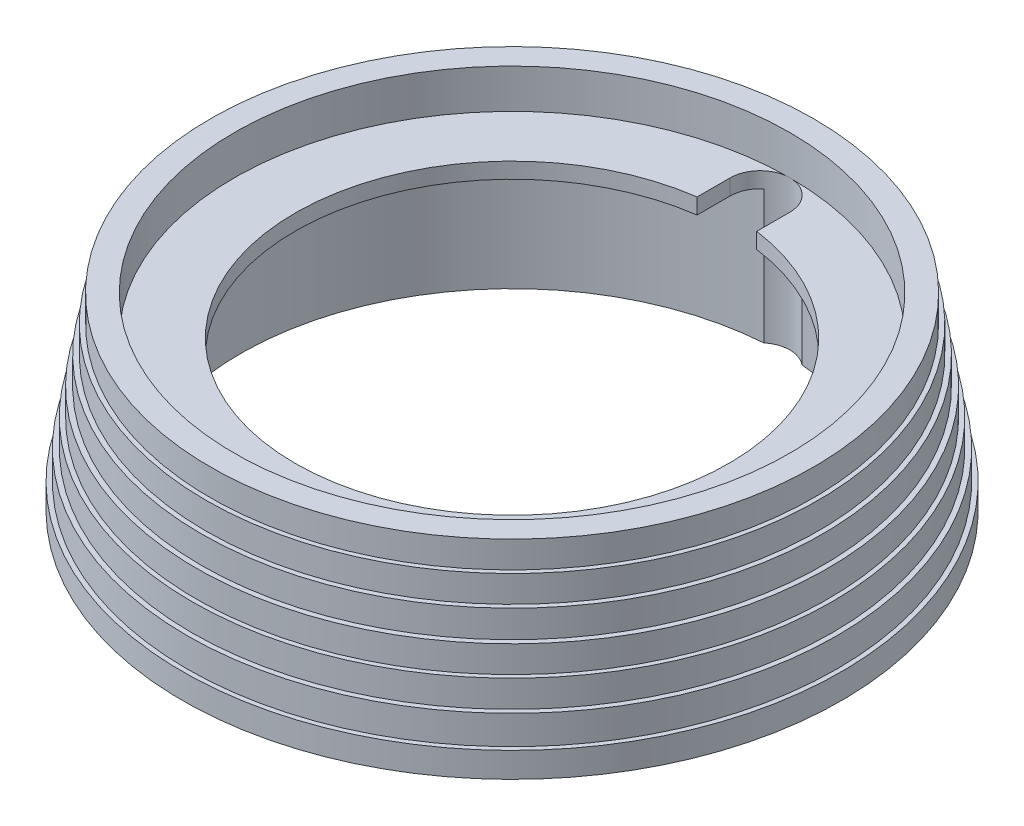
ISO-10303-21;
HEADER;
FILE_DESCRIPTION(('STEP AP214'),'2;1');
FILE_NAME('part.step','',(''),(''),'','','');
FILE_SCHEMA(('AUTOMOTIVE_DESIGN { 1 0 10303 214 1 1 1 1 }'));
ENDSEC;
DATA;
#1=APPLICATION_CONTEXT('core data for automotive mechanical design processes');
#2=APPLICATION_PROTOCOL_DEFINITION('international standard','automotive_design',2000,#1);
#3=PRODUCT_CONTEXT('',#1,'mechanical');
#4=PRODUCT('Part','Part','',(#3));
#5=PRODUCT_RELATED_PRODUCT_CATEGORY('part','',(#4));
#6=PRODUCT_DEFINITION_FORMATION('','',#4);
#7=PRODUCT_DEFINITION_CONTEXT('part definition',#1,'design');
#8=PRODUCT_DEFINITION('design','',#6,#7);
#9=PRODUCT_DEFINITION_SHAPE('','',#8);
#10=(LENGTH_UNIT() NAMED_UNIT(*) SI_UNIT(.MILLI.,.METRE.));
#11=(NAMED_UNIT(*) PLANE_ANGLE_UNIT() SI_UNIT($,.RADIAN.));
#12=(NAMED_UNIT(*) SI_UNIT($,.STERADIAN.) SOLID_ANGLE_UNIT());
#13=UNCERTAINTY_MEASURE_WITH_UNIT(LENGTH_MEASURE(1.E-05),#10,'distance_accuracy_value','');
#14=(GEOMETRIC_REPRESENTATION_CONTEXT(3) GLOBAL_UNCERTAINTY_ASSIGNED_CONTEXT((#13)) GLOBAL_UNIT_ASSIGNED_CONTEXT((#10,
#11,#12)) REPRESENTATION_CONTEXT('',''));
#15=CARTESIAN_POINT('',(0.,0.,0.));
#16=DIRECTION('',(0.,0.,1.));
#17=DIRECTION('',(1.,0.,0.));
#18=AXIS2_PLACEMENT_3D('',#15,#16,#17);
#19=CARTESIAN_POINT('',(0.,0.,0.));
#20=DIRECTION('',(0.,-1.,0.));
#21=DIRECTION('',(0.,0.,-1.));
#22=AXIS2_PLACEMENT_3D('',#19,#20,#21);
#23=CYLINDRICAL_SURFACE('',#22,17.5514);
#24=DIRECTION('',(0.,-1.,0.));
#25=VECTOR('',#24,1.);
#26=CARTESIAN_POINT('',(2.413,0.,-17.3847367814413));
#27=LINE('',#26,#25);
#28=CARTESIAN_POINT('',(2.413,10.795,-17.3847367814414));
#29=VERTEX_POINT('',#28);
#30=CARTESIAN_POINT('',(2.413,12.065,-17.3847367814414));
#31=VERTEX_POINT('',#30);
#32=EDGE_CURVE('E116',#29,#31,#27,.F.);
#33=ORIENTED_EDGE('',*,*,#32,.F.);
#34=CARTESIAN_POINT('',(0.,10.795,0.));
#35=DIRECTION('',(0.,-1.,0.));
#36=DIRECTION('',(0.,0.,-1.));
#37=AXIS2_PLACEMENT_3D('',#34,#35,#36);
#38=CIRCLE('',#37,17.5514);
#39=CARTESIAN_POINT('',(-2.413,10.795,-17.3847367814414));
#40=VERTEX_POINT('',#39);
#41=EDGE_CURVE('E129',#29,#40,#38,.T.);
#42=ORIENTED_EDGE('',*,*,#41,.T.);
#43=DIRECTION('',(0.,-1.,0.));
#44=VECTOR('',#43,1.);
#45=CARTESIAN_POINT('',(-2.413,0.,-17.3847367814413));
#46=LINE('',#45,#44);
#47=CARTESIAN_POINT('',(-2.413,12.065,-17.3847367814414));
#48=VERTEX_POINT('',#47);
#49=EDGE_CURVE('E50',#48,#40,#46,.T.);
#50=ORIENTED_EDGE('',*,*,#49,.F.);
#51=CARTESIAN_POINT('',(0.,12.065,0.));
#52=DIRECTION('',(0.,-1.,0.));
#53=DIRECTION('',(0.,0.,-1.));
#54=AXIS2_PLACEMENT_3D('',#51,#52,#53);
#55=CIRCLE('',#54,17.5514);
#56=EDGE_CURVE('E109',#31,#48,#55,.T.);
#57=ORIENTED_EDGE('',*,*,#56,.F.);
#58=EDGE_LOOP('',(#33,#42,#50,#57));
#59=FACE_BOUND('',#58,.T.);
#60=ADVANCED_FACE('F34',(#59),#23,.F.);
#61=CARTESIAN_POINT('',(26.67,0.,0.));
#62=DIRECTION('',(0.,-1.,0.));
#63=DIRECTION('',(0.,0.,-1.));
#64=AXIS2_PLACEMENT_3D('',#61,#62,#63);
#65=PLANE('',#64);
#66=CARTESIAN_POINT('',(0.,0.,-20.066));
#67=DIRECTION('',(0.,-1.,0.));
#68=DIRECTION('',(0.,0.,-1.));
#69=AXIS2_PLACEMENT_3D('',#66,#67,#68);
#70=CIRCLE('',#69,2.413);
#71=CARTESIAN_POINT('',(-1.54880738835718,0.,-21.9163417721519));
#72=VERTEX_POINT('',#71);
#73=CARTESIAN_POINT('',(1.54880738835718,0.,-21.9163417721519));
#74=VERTEX_POINT('',#73);
#75=EDGE_CURVE('E121',#72,#74,#70,.T.);
#76=ORIENTED_EDGE('',*,*,#75,.F.);
#77=CARTESIAN_POINT('',(0.,0.,0.));
#78=DIRECTION('',(0.,-1.,0.));
#79=DIRECTION('',(0.,0.,-1.));
#80=AXIS2_PLACEMENT_3D('',#77,#78,#79);
#81=CIRCLE('',#80,21.971);
#82=EDGE_CURVE('E125',#74,#72,#81,.T.);
#83=ORIENTED_EDGE('',*,*,#82,.F.);
#84=EDGE_LOOP('',(#76,#83));
#85=FACE_BOUND('',#84,.T.);
#86=CARTESIAN_POINT('',(0.,0.,0.));
#87=DIRECTION('',(0.,-1.,0.));
#88=DIRECTION('',(0.,0.,-1.));
#89=AXIS2_PLACEMENT_3D('',#86,#87,#88);
#90=CIRCLE('',#89,26.67);
#91=CARTESIAN_POINT('',(0.,0.,-26.67));
#92=VERTEX_POINT('',#91);
#93=EDGE_CURVE('E132',#92,#92,#90,.T.);
#94=ORIENTED_EDGE('',*,*,#93,.T.);
#95=EDGE_LOOP('',(#94));
#96=FACE_BOUND('',#95,.T.);
#97=ADVANCED_FACE('F36',(#85,#96),#65,.T.);
#98=CARTESIAN_POINT('',(17.5514,12.065,0.));
#99=DIRECTION('',(0.,1.,0.));
#100=DIRECTION('',(0.,0.,1.));
#101=AXIS2_PLACEMENT_3D('',#98,#99,#100);
#102=PLANE('',#101);
#103=DIRECTION('',(0.,0.,-1.));
#104=VECTOR('',#103,1.);
#105=CARTESIAN_POINT('',(2.413,12.065,-20.066));
#106=LINE('',#105,#104);
#107=CARTESIAN_POINT('',(2.413,12.065,-20.066));
#108=VERTEX_POINT('',#107);
#109=EDGE_CURVE('E103',#31,#108,#106,.T.);
#110=ORIENTED_EDGE('',*,*,#109,.F.);
#111=ORIENTED_EDGE('',*,*,#56,.T.);
#112=DIRECTION('',(0.,0.,1.));
#113=VECTOR('',#112,1.);
#114=CARTESIAN_POINT('',(-2.413,12.065,-20.066));
#115=LINE('',#114,#113);
#116=CARTESIAN_POINT('',(-2.413,12.065,-20.066));
#117=VERTEX_POINT('',#116);
#118=EDGE_CURVE('E100',#117,#48,#115,.T.);
#119=ORIENTED_EDGE('',*,*,#118,.F.);
#120=CARTESIAN_POINT('',(0.,12.065,-20.066));
#121=DIRECTION('',(0.,1.,0.));
#122=DIRECTION('',(0.,0.,1.));
#123=AXIS2_PLACEMENT_3D('',#120,#121,#122);
#124=CIRCLE('',#123,2.413);
#125=CARTESIAN_POINT('',(0.,12.065,-22.479));
#126=VERTEX_POINT('',#125);
#127=EDGE_CURVE('E88',#126,#117,#124,.T.);
#128=ORIENTED_EDGE('',*,*,#127,.F.);
#129=CARTESIAN_POINT('',(0.,12.065,0.));
#130=DIRECTION('',(0.,-1.,0.));
#131=DIRECTION('',(0.,0.,-1.));
#132=AXIS2_PLACEMENT_3D('',#129,#130,#131);
#133=CIRCLE('',#132,22.479);
#134=EDGE_CURVE('E177',#126,#126,#133,.T.);
#135=ORIENTED_EDGE('',*,*,#134,.F.);
#136=EDGE_CURVE('E93',#108,#126,#124,.T.);
#137=ORIENTED_EDGE('',*,*,#136,.F.);
#138=EDGE_LOOP('',(#110,#111,#119,#128,#135,#137));
#139=FACE_BOUND('',#138,.T.);
#140=ADVANCED_FACE('F107',(#139),#102,.T.);
#141=CARTESIAN_POINT('',(0.,0.,0.));
#142=DIRECTION('',(0.,-1.,0.));
#143=DIRECTION('',(0.,0.,-1.));
#144=AXIS2_PLACEMENT_3D('',#141,#142,#143);
#145=CYLINDRICAL_SURFACE('',#144,22.479);
#146=ORIENTED_EDGE('',*,*,#134,.T.);
#147=EDGE_LOOP('',(#146));
#148=FACE_BOUND('',#147,.T.);
#149=CARTESIAN_POINT('',(0.,15.24,0.));
#150=DIRECTION('',(0.,-1.,0.));
#151=DIRECTION('',(0.,0.,-1.));
#152=AXIS2_PLACEMENT_3D('',#149,#150,#151);
#153=CIRCLE('',#152,22.479);
#154=CARTESIAN_POINT('',(0.,15.24,-22.479));
#155=VERTEX_POINT('',#154);
#156=EDGE_CURVE('E174',#155,#155,#153,.T.);
#157=ORIENTED_EDGE('',*,*,#156,.F.);
#158=EDGE_LOOP('',(#157));
#159=FACE_BOUND('',#158,.T.);
#160=ADVANCED_FACE('F221',(#148,#159),#145,.F.);
#161=CARTESIAN_POINT('',(24.4094,15.24,0.));
#162=DIRECTION('',(0.,1.,0.));
#163=DIRECTION('',(0.,0.,1.));
#164=AXIS2_PLACEMENT_3D('',#161,#162,#163);
#165=PLANE('',#164);
#166=ORIENTED_EDGE('',*,*,#156,.T.);
#167=EDGE_LOOP('',(#166));
#168=FACE_BOUND('',#167,.T.);
#169=CARTESIAN_POINT('',(0.,15.24,0.));
#170=DIRECTION('',(0.,-1.,0.));
#171=DIRECTION('',(0.,0.,-1.));
#172=AXIS2_PLACEMENT_3D('',#169,#170,#171);
#173=CIRCLE('',#172,24.4094);
#174=CARTESIAN_POINT('',(0.,15.24,-24.4094));
#175=VERTEX_POINT('',#174);
#176=EDGE_CURVE('E171',#175,#175,#173,.T.);
#177=ORIENTED_EDGE('',*,*,#176,.F.);
#178=EDGE_LOOP('',(#177));
#179=FACE_BOUND('',#178,.T.);
#180=ADVANCED_FACE('F224',(#168,#179),#165,.T.);
#181=CARTESIAN_POINT('',(0.,0.,0.));
#182=DIRECTION('',(0.,-1.,0.));
#183=DIRECTION('',(0.,0.,-1.));
#184=AXIS2_PLACEMENT_3D('',#181,#182,#183);
#185=CYLINDRICAL_SURFACE('',#184,24.4094);
#186=ORIENTED_EDGE('',*,*,#176,.T.);
#187=EDGE_LOOP('',(#186));
#188=FACE_BOUND('',#187,.T.);
#189=CARTESIAN_POINT('',(0.,13.081,0.));
#190=DIRECTION('',(0.,-1.,0.));
#191=DIRECTION('',(0.,0.,-1.));
#192=AXIS2_PLACEMENT_3D('',#189,#190,#191);
#193=CIRCLE('',#192,24.4094);
#194=CARTESIAN_POINT('',(0.,13.081,-24.4094));
#195=VERTEX_POINT('',#194);
#196=EDGE_CURVE('E168',#195,#195,#193,.T.);
#197=ORIENTED_EDGE('',*,*,#196,.F.);
#198=EDGE_LOOP('',(#197));
#199=FACE_BOUND('',#198,.T.);
#200=ADVANCED_FACE('F228',(#188,#199),#185,.T.);
#201=CARTESIAN_POINT('',(24.765,13.081,0.));
#202=DIRECTION('',(0.,1.,0.));
#203=DIRECTION('',(0.,0.,1.));
#204=AXIS2_PLACEMENT_3D('',#201,#202,#203);
#205=PLANE('',#204);
#206=ORIENTED_EDGE('',*,*,#196,.T.);
#207=EDGE_LOOP('',(#206));
#208=FACE_BOUND('',#207,.T.);
#209=CARTESIAN_POINT('',(0.,13.081,0.));
#210=DIRECTION('',(0.,-1.,0.));
#211=DIRECTION('',(0.,0.,-1.));
#212=AXIS2_PLACEMENT_3D('',#209,#210,#211);
#213=CIRCLE('',#212,24.765);
#214=CARTESIAN_POINT('',(0.,13.081,-24.765));
#215=VERTEX_POINT('',#214);
#216=EDGE_CURVE('E165',#215,#215,#213,.T.);
#217=ORIENTED_EDGE('',*,*,#216,.F.);
#218=EDGE_LOOP('',(#217));
#219=FACE_BOUND('',#218,.T.);
#220=ADVANCED_FACE('F232',(#208,#219),#205,.T.);
#221=CARTESIAN_POINT('',(0.,0.,0.));
#222=DIRECTION('',(0.,-1.,0.));
#223=DIRECTION('',(0.,0.,-1.));
#224=AXIS2_PLACEMENT_3D('',#221,#222,#223);
#225=CYLINDRICAL_SURFACE('',#224,24.765);
#226=ORIENTED_EDGE('',*,*,#216,.T.);
#227=EDGE_LOOP('',(#226));
#228=FACE_BOUND('',#227,.T.);
#229=CARTESIAN_POINT('',(0.,10.922,0.));
#230=DIRECTION('',(0.,-1.,0.));
#231=DIRECTION('',(0.,0.,-1.));
#232=AXIS2_PLACEMENT_3D('',#229,#230,#231);
#233=CIRCLE('',#232,24.765);
#234=CARTESIAN_POINT('',(0.,10.922,-24.765));
#235=VERTEX_POINT('',#234);
#236=EDGE_CURVE('E162',#235,#235,#233,.T.);
#237=ORIENTED_EDGE('',*,*,#236,.F.);
#238=EDGE_LOOP('',(#237));
#239=FACE_BOUND('',#238,.T.);
#240=ADVANCED_FACE('F236',(#228,#239),#225,.T.);
#241=CARTESIAN_POINT('',(25.146,10.922,0.));
#242=DIRECTION('',(0.,1.,0.));
#243=DIRECTION('',(0.,0.,1.));
#244=AXIS2_PLACEMENT_3D('',#241,#242,#243);
#245=PLANE('',#244);
#246=ORIENTED_EDGE('',*,*,#236,.T.);
#247=EDGE_LOOP('',(#246));
#248=FACE_BOUND('',#247,.T.);
#249=CARTESIAN_POINT('',(0.,10.922,0.));
#250=DIRECTION('',(0.,-1.,0.));
#251=DIRECTION('',(0.,0.,-1.));
#252=AXIS2_PLACEMENT_3D('',#249,#250,#251);
#253=CIRCLE('',#252,25.146);
#254=CARTESIAN_POINT('',(0.,10.922,-25.146));
#255=VERTEX_POINT('',#254);
#256=EDGE_CURVE('E159',#255,#255,#253,.T.);
#257=ORIENTED_EDGE('',*,*,#256,.F.);
#258=EDGE_LOOP('',(#257));
#259=FACE_BOUND('',#258,.T.);
#260=ADVANCED_FACE('F240',(#248,#259),#245,.T.);
#261=CARTESIAN_POINT('',(0.,0.,0.));
#262=DIRECTION('',(0.,-1.,0.));
#263=DIRECTION('',(0.,0.,-1.));
#264=AXIS2_PLACEMENT_3D('',#261,#262,#263);
#265=CYLINDRICAL_SURFACE('',#264,25.146);
#266=ORIENTED_EDGE('',*,*,#256,.T.);
#267=EDGE_LOOP('',(#266));
#268=FACE_BOUND('',#267,.T.);
#269=CARTESIAN_POINT('',(0.,8.7122,0.));
#270=DIRECTION('',(0.,-1.,0.));
#271=DIRECTION('',(0.,0.,-1.));
#272=AXIS2_PLACEMENT_3D('',#269,#270,#271);
#273=CIRCLE('',#272,25.146);
#274=CARTESIAN_POINT('',(0.,8.7122,-25.146));
#275=VERTEX_POINT('',#274);
#276=EDGE_CURVE('E156',#275,#275,#273,.T.);
#277=ORIENTED_EDGE('',*,*,#276,.F.);
#278=EDGE_LOOP('',(#277));
#279=FACE_BOUND('',#278,.T.);
#280=ADVANCED_FACE('F244',(#268,#279),#265,.T.);
#281=CARTESIAN_POINT('',(25.5524,8.7122,0.));
#282=DIRECTION('',(0.,1.,0.));
#283=DIRECTION('',(0.,0.,1.));
#284=AXIS2_PLACEMENT_3D('',#281,#282,#283);
#285=PLANE('',#284);
#286=ORIENTED_EDGE('',*,*,#276,.T.);
#287=EDGE_LOOP('',(#286));
#288=FACE_BOUND('',#287,.T.);
#289=CARTESIAN_POINT('',(0.,8.7122,0.));
#290=DIRECTION('',(0.,-1.,0.));
#291=DIRECTION('',(0.,0.,-1.));
#292=AXIS2_PLACEMENT_3D('',#289,#290,#291);
#293=CIRCLE('',#292,25.5524);
#294=CARTESIAN_POINT('',(0.,8.7122,-25.5524));
#295=VERTEX_POINT('',#294);
#296=EDGE_CURVE('E153',#295,#295,#293,.T.);
#297=ORIENTED_EDGE('',*,*,#296,.F.);
#298=EDGE_LOOP('',(#297));
#299=FACE_BOUND('',#298,.T.);
#300=ADVANCED_FACE('F248',(#288,#299),#285,.T.);
#301=CARTESIAN_POINT('',(0.,0.,0.));
#302=DIRECTION('',(0.,-1.,0.));
#303=DIRECTION('',(0.,0.,-1.));
#304=AXIS2_PLACEMENT_3D('',#301,#302,#303);
#305=CYLINDRICAL_SURFACE('',#304,25.5524);
#306=ORIENTED_EDGE('',*,*,#296,.T.);
#307=EDGE_LOOP('',(#306));
#308=FACE_BOUND('',#307,.T.);
#309=CARTESIAN_POINT('',(0.,6.5532,0.));
#310=DIRECTION('',(0.,-1.,0.));
#311=DIRECTION('',(0.,0.,-1.));
#312=AXIS2_PLACEMENT_3D('',#309,#310,#311);
#313=CIRCLE('',#312,25.5524);
#314=CARTESIAN_POINT('',(0.,6.5532,-25.5524));
#315=VERTEX_POINT('',#314);
#316=EDGE_CURVE('E150',#315,#315,#313,.T.);
#317=ORIENTED_EDGE('',*,*,#316,.F.);
#318=EDGE_LOOP('',(#317));
#319=FACE_BOUND('',#318,.T.);
#320=ADVANCED_FACE('F252',(#308,#319),#305,.T.);
#321=CARTESIAN_POINT('',(25.908,6.5532,0.));
#322=DIRECTION('',(0.,1.,0.));
#323=DIRECTION('',(0.,0.,1.));
#324=AXIS2_PLACEMENT_3D('',#321,#322,#323);
#325=PLANE('',#324);
#326=ORIENTED_EDGE('',*,*,#316,.T.);
#327=EDGE_LOOP('',(#326));
#328=FACE_BOUND('',#327,.T.);
#329=CARTESIAN_POINT('',(0.,6.5532,0.));
#330=DIRECTION('',(0.,-1.,0.));
#331=DIRECTION('',(0.,0.,-1.));
#332=AXIS2_PLACEMENT_3D('',#329,#330,#331);
#333=CIRCLE('',#332,25.908);
#334=CARTESIAN_POINT('',(0.,6.5532,-25.908));
#335=VERTEX_POINT('',#334);
#336=EDGE_CURVE('E147',#335,#335,#333,.T.);
#337=ORIENTED_EDGE('',*,*,#336,.F.);
#338=EDGE_LOOP('',(#337));
#339=FACE_BOUND('',#338,.T.);
#340=ADVANCED_FACE('F256',(#328,#339),#325,.T.);
#341=CARTESIAN_POINT('',(0.,0.,0.));
#342=DIRECTION('',(0.,-1.,0.));
#343=DIRECTION('',(0.,0.,-1.));
#344=AXIS2_PLACEMENT_3D('',#341,#342,#343);
#345=CYLINDRICAL_SURFACE('',#344,25.908);
#346=ORIENTED_EDGE('',*,*,#336,.T.);
#347=EDGE_LOOP('',(#346));
#348=FACE_BOUND('',#347,.T.);
#349=CARTESIAN_POINT('',(0.,4.3688,0.));
#350=DIRECTION('',(0.,-1.,0.));
#351=DIRECTION('',(0.,0.,-1.));
#352=AXIS2_PLACEMENT_3D('',#349,#350,#351);
#353=CIRCLE('',#352,25.908);
#354=CARTESIAN_POINT('',(0.,4.3688,-25.908));
#355=VERTEX_POINT('',#354);
#356=EDGE_CURVE('E144',#355,#355,#353,.T.);
#357=ORIENTED_EDGE('',*,*,#356,.F.);
#358=EDGE_LOOP('',(#357));
#359=FACE_BOUND('',#358,.T.);
#360=ADVANCED_FACE('F260',(#348,#359),#345,.T.);
#361=CARTESIAN_POINT('',(26.3017,4.3688,0.));
#362=DIRECTION('',(0.,1.,0.));
#363=DIRECTION('',(0.,0.,1.));
#364=AXIS2_PLACEMENT_3D('',#361,#362,#363);
#365=PLANE('',#364);
#366=ORIENTED_EDGE('',*,*,#356,.T.);
#367=EDGE_LOOP('',(#366));
#368=FACE_BOUND('',#367,.T.);
#369=CARTESIAN_POINT('',(0.,4.3688,0.));
#370=DIRECTION('',(0.,-1.,0.));
#371=DIRECTION('',(0.,0.,-1.));
#372=AXIS2_PLACEMENT_3D('',#369,#370,#371);
#373=CIRCLE('',#372,26.3017);
#374=CARTESIAN_POINT('',(0.,4.3688,-26.3017));
#375=VERTEX_POINT('',#374);
#376=EDGE_CURVE('E141',#375,#375,#373,.T.);
#377=ORIENTED_EDGE('',*,*,#376,.F.);
#378=EDGE_LOOP('',(#377));
#379=FACE_BOUND('',#378,.T.);
#380=ADVANCED_FACE('F264',(#368,#379),#365,.T.);
#381=CARTESIAN_POINT('',(0.,0.,0.));
#382=DIRECTION('',(0.,-1.,0.));
#383=DIRECTION('',(0.,0.,-1.));
#384=AXIS2_PLACEMENT_3D('',#381,#382,#383);
#385=CYLINDRICAL_SURFACE('',#384,26.3017);
#386=ORIENTED_EDGE('',*,*,#376,.T.);
#387=EDGE_LOOP('',(#386));
#388=FACE_BOUND('',#387,.T.);
#389=CARTESIAN_POINT('',(0.,2.032,0.));
#390=DIRECTION('',(0.,-1.,0.));
#391=DIRECTION('',(0.,0.,-1.));
#392=AXIS2_PLACEMENT_3D('',#389,#390,#391);
#393=CIRCLE('',#392,26.3017);
#394=CARTESIAN_POINT('',(0.,2.032,-26.3017));
#395=VERTEX_POINT('',#394);
#396=EDGE_CURVE('E138',#395,#395,#393,.T.);
#397=ORIENTED_EDGE('',*,*,#396,.F.);
#398=EDGE_LOOP('',(#397));
#399=FACE_BOUND('',#398,.T.);
#400=ADVANCED_FACE('F212',(#388,#399),#385,.T.);
#401=CARTESIAN_POINT('',(26.67,2.032,0.));
#402=DIRECTION('',(0.,1.,0.));
#403=DIRECTION('',(0.,0.,1.));
#404=AXIS2_PLACEMENT_3D('',#401,#402,#403);
#405=PLANE('',#404);
#406=ORIENTED_EDGE('',*,*,#396,.T.);
#407=EDGE_LOOP('',(#406));
#408=FACE_BOUND('',#407,.T.);
#409=CARTESIAN_POINT('',(0.,2.032,0.));
#410=DIRECTION('',(0.,-1.,0.));
#411=DIRECTION('',(0.,0.,-1.));
#412=AXIS2_PLACEMENT_3D('',#409,#410,#411);
#413=CIRCLE('',#412,26.67);
#414=CARTESIAN_POINT('',(0.,2.032,-26.67));
#415=VERTEX_POINT('',#414);
#416=EDGE_CURVE('E135',#415,#415,#413,.T.);
#417=ORIENTED_EDGE('',*,*,#416,.F.);
#418=EDGE_LOOP('',(#417));
#419=FACE_BOUND('',#418,.T.);
#420=ADVANCED_FACE('F204',(#408,#419),#405,.T.);
#421=CARTESIAN_POINT('',(0.,0.,0.));
#422=DIRECTION('',(0.,-1.,0.));
#423=DIRECTION('',(0.,0.,-1.));
#424=AXIS2_PLACEMENT_3D('',#421,#422,#423);
#425=CYLINDRICAL_SURFACE('',#424,26.67);
#426=ORIENTED_EDGE('',*,*,#416,.T.);
#427=EDGE_LOOP('',(#426));
#428=FACE_BOUND('',#427,.T.);
#429=ORIENTED_EDGE('',*,*,#93,.F.);
#430=EDGE_LOOP('',(#429));
#431=FACE_BOUND('',#430,.T.);
#432=ADVANCED_FACE('F202',(#428,#431),#425,.T.);
#433=CARTESIAN_POINT('',(0.,10.795,0.));
#434=DIRECTION('',(0.,-1.,0.));
#435=DIRECTION('',(0.,0.,-1.));
#436=AXIS2_PLACEMENT_3D('',#433,#434,#435);
#437=CYLINDRICAL_SURFACE('',#436,21.971);
#438=CARTESIAN_POINT('',(0.,10.795,0.));
#439=DIRECTION('',(0.,-1.,0.));
#440=DIRECTION('',(0.,0.,-1.));
#441=AXIS2_PLACEMENT_3D('',#438,#439,#440);
#442=CIRCLE('',#441,21.971);
#443=CARTESIAN_POINT('',(1.54880738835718,10.795,-21.9163417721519));
#444=VERTEX_POINT('',#443);
#445=CARTESIAN_POINT('',(-1.54880738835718,10.795,-21.9163417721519));
#446=VERTEX_POINT('',#445);
#447=EDGE_CURVE('E126',#444,#446,#442,.T.);
#448=ORIENTED_EDGE('',*,*,#447,.F.);
#449=DIRECTION('',(0.,1.,0.));
#450=VECTOR('',#449,1.);
#451=CARTESIAN_POINT('',(1.54880738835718,5.969,-21.9163417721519));
#452=LINE('',#451,#450);
#453=EDGE_CURVE('E118',#444,#74,#452,.F.);
#454=ORIENTED_EDGE('',*,*,#453,.T.);
#455=ORIENTED_EDGE('',*,*,#82,.T.);
#456=DIRECTION('',(0.,1.,0.));
#457=VECTOR('',#456,1.);
#458=CARTESIAN_POINT('',(-1.54880738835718,5.969,-21.9163417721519));
#459=LINE('',#458,#457);
#460=EDGE_CURVE('E123',#72,#446,#459,.T.);
#461=ORIENTED_EDGE('',*,*,#460,.T.);
#462=EDGE_LOOP('',(#448,#454,#455,#461));
#463=FACE_BOUND('',#462,.T.);
#464=ADVANCED_FACE('F194',(#463),#437,.F.);
#465=CARTESIAN_POINT('',(0.,10.795,0.));
#466=DIRECTION('',(0.,-1.,0.));
#467=DIRECTION('',(0.,0.,-1.));
#468=AXIS2_PLACEMENT_3D('',#465,#466,#467);
#469=PLANE('',#468);
#470=CARTESIAN_POINT('',(0.,10.795,-20.066));
#471=DIRECTION('',(0.,-1.,0.));
#472=DIRECTION('',(0.,0.,-1.));
#473=AXIS2_PLACEMENT_3D('',#470,#471,#472);
#474=CIRCLE('',#473,2.413);
#475=CARTESIAN_POINT('',(2.413,10.795,-20.066));
#476=VERTEX_POINT('',#475);
#477=EDGE_CURVE('E11',#444,#476,#474,.T.);
#478=ORIENTED_EDGE('',*,*,#477,.F.);
#479=ORIENTED_EDGE('',*,*,#447,.T.);
#480=CARTESIAN_POINT('',(-2.413,10.795,-20.066));
#481=VERTEX_POINT('',#480);
#482=EDGE_CURVE('E43',#481,#446,#474,.T.);
#483=ORIENTED_EDGE('',*,*,#482,.F.);
#484=DIRECTION('',(0.,0.,-1.));
#485=VECTOR('',#484,1.);
#486=CARTESIAN_POINT('',(-2.413,10.795,0.));
#487=LINE('',#486,#485);
#488=EDGE_CURVE('E101',#40,#481,#487,.T.);
#489=ORIENTED_EDGE('',*,*,#488,.F.);
#490=ORIENTED_EDGE('',*,*,#41,.F.);
#491=DIRECTION('',(0.,0.,1.));
#492=VECTOR('',#491,1.);
#493=CARTESIAN_POINT('',(2.413,10.795,0.));
#494=LINE('',#493,#492);
#495=EDGE_CURVE('E38',#476,#29,#494,.T.);
#496=ORIENTED_EDGE('',*,*,#495,.F.);
#497=EDGE_LOOP('',(#478,#479,#483,#489,#490,#496));
#498=FACE_BOUND('',#497,.T.);
#499=ADVANCED_FACE('F191',(#498),#469,.T.);
#500=CARTESIAN_POINT('',(0.,-0.127000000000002,-20.066));
#501=DIRECTION('',(0.,1.,0.));
#502=DIRECTION('',(0.,0.,1.));
#503=AXIS2_PLACEMENT_3D('',#500,#501,#502);
#504=CYLINDRICAL_SURFACE('',#503,2.413);
#505=ORIENTED_EDGE('',*,*,#482,.T.);
#506=ORIENTED_EDGE('',*,*,#460,.F.);
#507=ORIENTED_EDGE('',*,*,#75,.T.);
#508=ORIENTED_EDGE('',*,*,#453,.F.);
#509=ORIENTED_EDGE('',*,*,#477,.T.);
#510=DIRECTION('',(0.,1.,0.));
#511=VECTOR('',#510,1.);
#512=CARTESIAN_POINT('',(2.413,-0.127000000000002,-20.066));
#513=LINE('',#512,#511);
#514=EDGE_CURVE('E102',#476,#108,#513,.T.);
#515=ORIENTED_EDGE('',*,*,#514,.T.);
#516=ORIENTED_EDGE('',*,*,#136,.T.);
#517=ORIENTED_EDGE('',*,*,#127,.T.);
#518=DIRECTION('',(0.,1.,0.));
#519=VECTOR('',#518,1.);
#520=CARTESIAN_POINT('',(-2.413,-0.127000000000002,-20.066));
#521=LINE('',#520,#519);
#522=EDGE_CURVE('E91',#481,#117,#521,.T.);
#523=ORIENTED_EDGE('',*,*,#522,.F.);
#524=EDGE_LOOP('',(#505,#506,#507,#508,#509,#515,#516,#517,#523));
#525=FACE_BOUND('',#524,.T.);
#526=ADVANCED_FACE('F90',(#525),#504,.F.);
#527=CARTESIAN_POINT('',(2.413,-0.127000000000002,-20.066));
#528=DIRECTION('',(1.,0.,0.));
#529=DIRECTION('',(0.,0.,-1.));
#530=AXIS2_PLACEMENT_3D('',#527,#528,#529);
#531=PLANE('',#530);
#532=ORIENTED_EDGE('',*,*,#32,.T.);
#533=ORIENTED_EDGE('',*,*,#109,.T.);
#534=ORIENTED_EDGE('',*,*,#514,.F.);
#535=ORIENTED_EDGE('',*,*,#495,.T.);
#536=EDGE_LOOP('',(#532,#533,#534,#535));
#537=FACE_BOUND('',#536,.T.);
#538=ADVANCED_FACE('F186',(#537),#531,.F.);
#539=CARTESIAN_POINT('',(-2.413,-0.127000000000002,-20.066));
#540=DIRECTION('',(-1.,0.,0.));
#541=DIRECTION('',(0.,0.,1.));
#542=AXIS2_PLACEMENT_3D('',#539,#540,#541);
#543=PLANE('',#542);
#544=ORIENTED_EDGE('',*,*,#49,.T.);
#545=ORIENTED_EDGE('',*,*,#488,.T.);
#546=ORIENTED_EDGE('',*,*,#522,.T.);
#547=ORIENTED_EDGE('',*,*,#118,.T.);
#548=EDGE_LOOP('',(#544,#545,#546,#547));
#549=FACE_BOUND('',#548,.T.);
#550=ADVANCED_FACE('F99',(#549),#543,.F.);
#551=CLOSED_SHELL('',(#60,#97,#140,#160,#180,#200,#220,#240,#260,#280,#300,#320,#340,#360,#380,
#400,#420,#432,#464,#499,#526,#538,#550));
#552=MANIFOLD_SOLID_BREP('B2',#551);
#553=ADVANCED_BREP_SHAPE_REPRESENTATION('',(#18,#552),#14);
#554=SHAPE_DEFINITION_REPRESENTATION(#9,#553);
ENDSEC;
END-ISO-10303-21;
